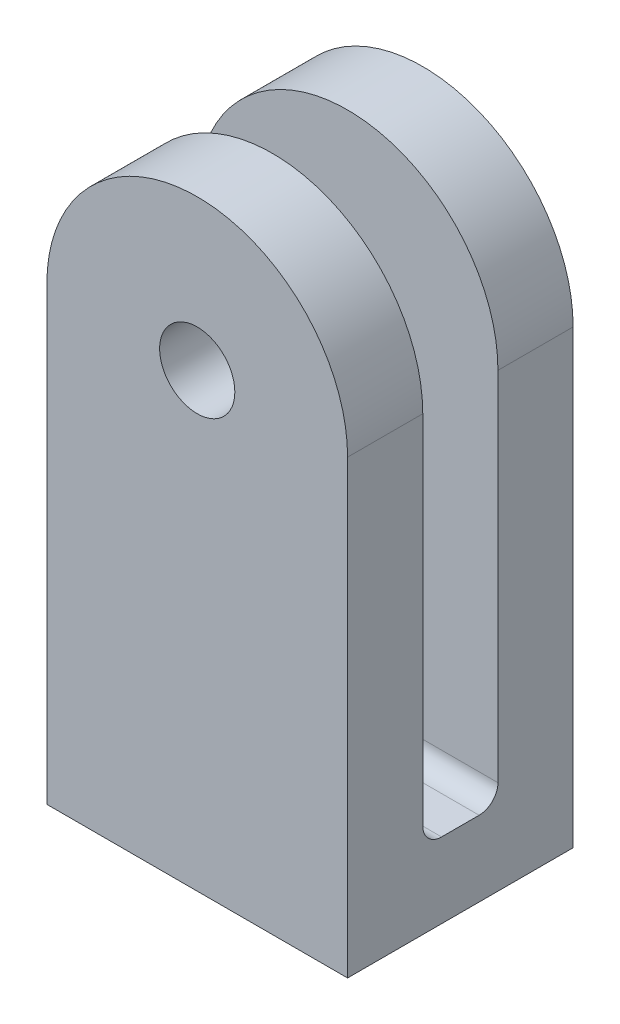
from build123d import *

# Parameters (mm, degrees)
EXTRUDE1_DEPTH     = 19.05
CUT_EXTRUDE3_DEPTH = 116.178567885
SKETCH3_R          = 6.35
CUT_EXTRUDE4_DEPTH = 112.44204772


with BuildPart() as part:
    # Sketch1 → Extrude1 (new, symmetric)
    with BuildSketch(Plane.XY):
        with BuildLine():
            Line((-25.4, 0), (25.4, 0))
            Line((25.4, 0), (25.4, 76.2))
            ThreePointArc((25.4, 76.2), (0, 101.6), (-25.4, 76.2))
            Line((-25.4, 76.2), (-25.4, 0))
        make_face()
    extrude(amount=EXTRUDE1_DEPTH, both=True)

    # Sketch2 → Cut-Extrude3 (cut, through all)
    with BuildSketch(Plane(origin=(25.4, 0, 0), x_dir=(0, 0, -1), z_dir=(1, 0, 0))):
        with BuildLine():
            Line((-6.35, 101.6), (6.35, 101.6))
            Line((6.35, 101.6), (6.35, 15.875))
            ThreePointArc((6.35, 15.875), (5.42006403, 13.62993597), (3.175, 12.7))
            Line((3.175, 12.7), (-3.175, 12.7))
            ThreePointArc((-3.175, 12.7), (-5.42006403, 13.62993597), (-6.35, 15.875))
            Line((-6.35, 15.875), (-6.35, 101.6))
        make_face()
    extrude(amount=-CUT_EXTRUDE3_DEPTH, mode=Mode.SUBTRACT)

    # Sketch3 → Cut-Extrude4 (cut, through all)
    with BuildSketch(Plane.XY.offset(19.05)):
        with Locations((0, 76.2)):
            Circle(SKETCH3_R)
    extrude(amount=-CUT_EXTRUDE4_DEPTH, mode=Mode.SUBTRACT)


solid = part.part
